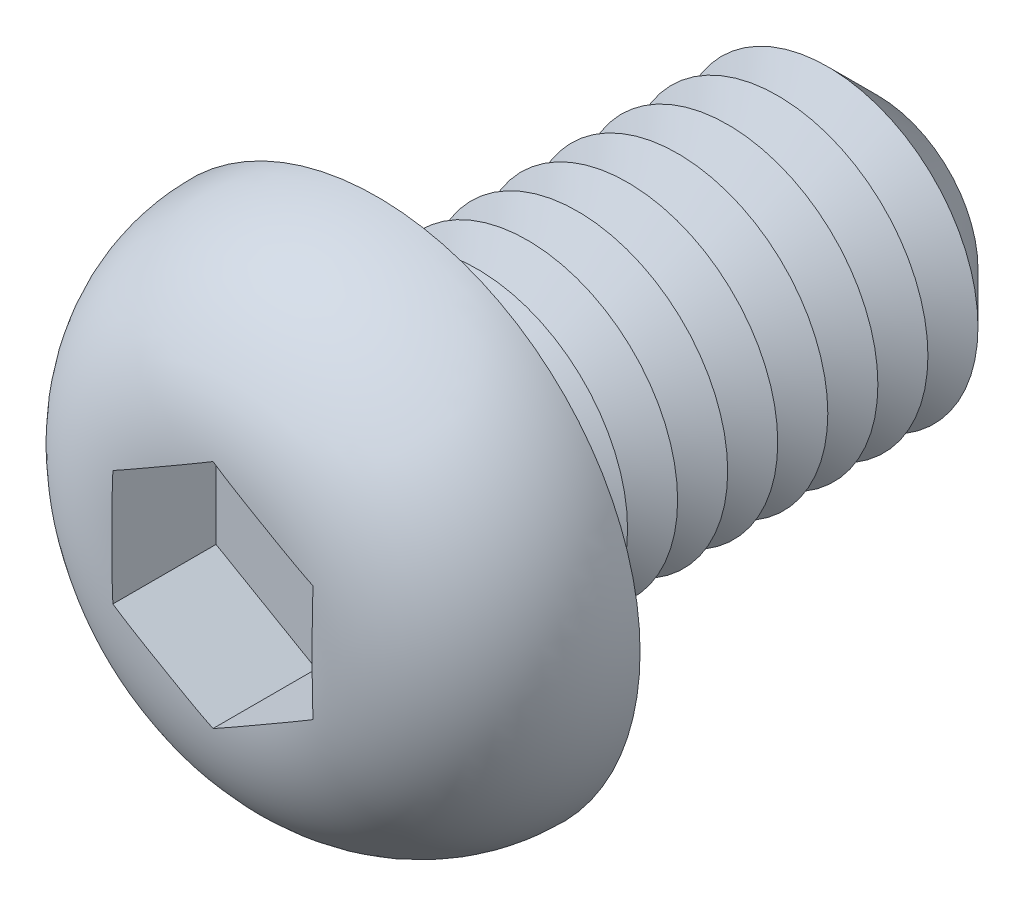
from build123d import *

# Parameters (mm, degrees)
CUT_EXTRUDE1_DEPTH  = 2.08
SKETCH4_R           = 3
BOSS_EXTRUDE1_DEPTH = 10
CHAMFER1_SIZE       = 1
LPATTERN1_COUNT     = 8
LPATTERN1_PITCH     = 1
FILLET2_R           = 0.5
SKETCH6_R           = 0.8
CUT_EXTRUDE2_DEPTH  = 11.22


with BuildPart() as part:
    # Sketch2 → Revolve1 (revolve)
    with BuildSketch(Plane(origin=(0, 0, 0), x_dir=(0, 0, -1), z_dir=(1, 0, 0)), mode=Mode.PRIVATE) as revolve1_sk:
        with BuildLine():
            Line((0, 0), (-3.3, 0))
            Line((-3.3, 0), (-3.3, 1.95))
            ThreePointArc((-3.3, 1.95), (-2.333452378, 4.283452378), (0, 5.25))
            Line((0, 5.25), (0, 0))
        make_face()
    revolve(revolve1_sk.sketch.rotate(Axis((0, 0, 47.934239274), (0, 0, -1)), 90), axis=Axis((0, 0, 47.934239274), (0, 0, -1)))

    # Sketch3 → Cut-Extrude1 (cut)
    with BuildSketch(Plane.XY.offset(3.3)):
        Polygon((0, 2.309401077), (-2, 1.154700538), (-2, -1.154700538), (0, -2.309401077), (2, -1.154700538), (2, 1.154700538), align=None)
    extrude(amount=-CUT_EXTRUDE1_DEPTH, mode=Mode.SUBTRACT)

    # Sketch4 → Boss-Extrude1 (add)
    with BuildSketch(Plane(origin=(0, 0, 0), x_dir=(-1, 0, 0), z_dir=(0, 0, -1))):
        with Locations(Location((0, 0, 0), (0, 0, 180))):
            Circle(SKETCH4_R)
    extrude(amount=BOSS_EXTRUDE1_DEPTH)

    # Chamfer1
    chamfer1_edges = [part.edges().sort_by_distance(p)[0] for p in [
        (-3, 0, -10),
    ]]
    chamfer(chamfer1_edges, length=CHAMFER1_SIZE)

    # Sketch5 → Cut-Revolve1 (revolve, cut)
    with BuildSketch(Plane(origin=(0, 0, 0), x_dir=(0, 0, -1), z_dir=(1, 0, 0)), mode=Mode.PRIVATE) as cut_revolve1_sk:
        Polygon((1, 3), (2, 3), (1.5, 2.133974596), align=None)
    cut_revolve1 = revolve(cut_revolve1_sk.sketch.rotate(Axis((0, 0, 47.934239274), (0, 0, -1)), 90), axis=Axis((0, 0, 47.934239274), (0, 0, -1)), mode=Mode.SUBTRACT)

    # LPattern1: Cut-Revolve1 ×8
    with Locations(*[(0, 0, -i * LPATTERN1_PITCH) for i in range(1, LPATTERN1_COUNT)]):
        add(cut_revolve1, mode=Mode.SUBTRACT)

    # Fillet2
    fillet2_edges = [part.edges().sort_by_distance(p)[0] for p in [
        (-3, 0, 0),
    ]]
    fillet(fillet2_edges, radius=FILLET2_R)

    # Sketch6 → Cut-Extrude2 (cut)
    with BuildSketch(Plane.XY.offset(1.22)):
        Circle(SKETCH6_R)
    extrude(amount=-CUT_EXTRUDE2_DEPTH, mode=Mode.SUBTRACT)


solid = part.part
